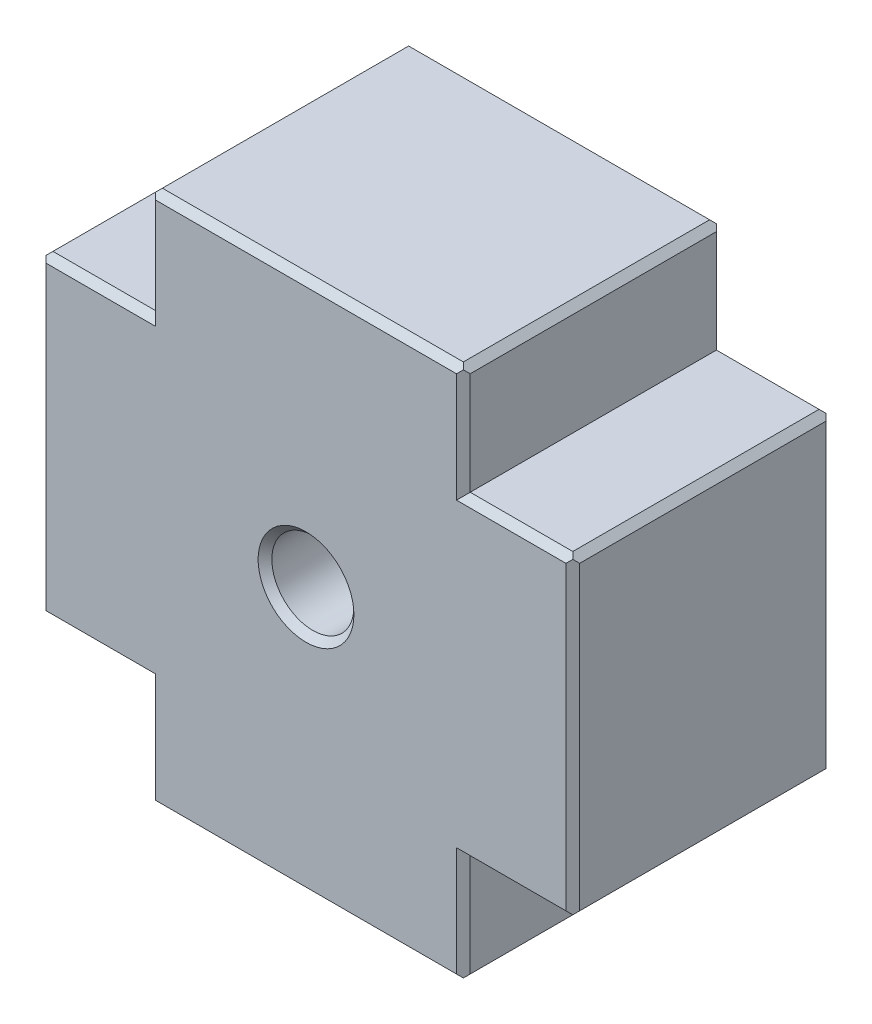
from build123d import *

# Parameters (mm, degrees)
EXTRUDE_1_DEPTH     = 19
CHAMFER_1_SIZE      = 0.5
CHAMFER_2_SIZE      = 0.5
SKETCH_2_R          = 3
CUT_EXTRUDE_1_DEPTH = 34.488804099
CHAMFER_3_SIZE      = 0.5


with BuildPart() as part:
    # Sketch 1 → Extrude 1 (new body)
    with BuildSketch(Plane.XY):
        Polygon((-11.5, -19.5), (11.5, -19.5), (11.5, -11.5), (19.5, -11.5), (19.5, 11.5), (11.5, 11.5), (11.5, 19.5), (-11.5, 19.5), (-11.5, 11.5), (-19.5, 11.5), (-19.5, -11.5), (-11.5, -11.5), align=None)
    extrude(amount=EXTRUDE_1_DEPTH)

    # Chamfer 1
    chamfer_1_edges = [part.edges().sort_by_distance(p)[0] for p in [
        (-19.5, 0, 0),
        (0, -19.5, 19),
        (-15.5, 11.5, 0),
        (-11.5, 15.5, 0),
        (0, 19.5, 0),
        (11.5, 15.5, 0),
        (15.5, 11.5, 0),
        (19.5, 0, 0),
        (15.5, -11.5, 0),
        (11.5, -15.5, 0),
        (11.5, -15.5, 19),
        (0, -19.5, 0),
        (-11.5, -15.5, 0),
        (-15.5, -11.5, 0),
        (15.5, -11.5, 19),
        (19.5, 0, 19),
        (15.5, 11.5, 19),
        (11.5, 15.5, 19),
        (0, 19.5, 19),
        (-11.5, 15.5, 19),
        (-15.5, 11.5, 19),
        (-19.5, 0, 19),
        (-15.5, -11.5, 19),
        (-11.5, -15.5, 19),
    ]]
    chamfer(chamfer_1_edges, length=CHAMFER_1_SIZE)

    # Chamfer 2
    chamfer_2_edges = [part.edges().sort_by_distance(p)[0] for p in [
        (-11.5, -19.5, 9.5),
        (11.5, -19.5, 9.5),
        (19.5, -11.5, 9.5),
        (19.5, 11.5, 9.5),
        (11.5, 19.5, 9.5),
        (-11.5, 19.5, 9.5),
        (-19.5, 11.5, 9.5),
        (-19.5, -11.5, 9.5),
    ]]
    chamfer(chamfer_2_edges, length=CHAMFER_2_SIZE)

    # Sketch 2 → Cut-Extrude 1 (cut, through all)
    with BuildSketch(Plane(origin=(0, 0, 0), x_dir=(-1, 0, 0), z_dir=(0, 0, -1))):
        Circle(SKETCH_2_R)
    extrude(amount=-CUT_EXTRUDE_1_DEPTH, mode=Mode.SUBTRACT)

    # Chamfer 3
    chamfer_3_edges = [part.edges().sort_by_distance(p)[0] for p in [
        (3, 0, 19),
        (3, 0, 0),
    ]]
    chamfer(chamfer_3_edges, length=CHAMFER_3_SIZE)


solid = part.part
